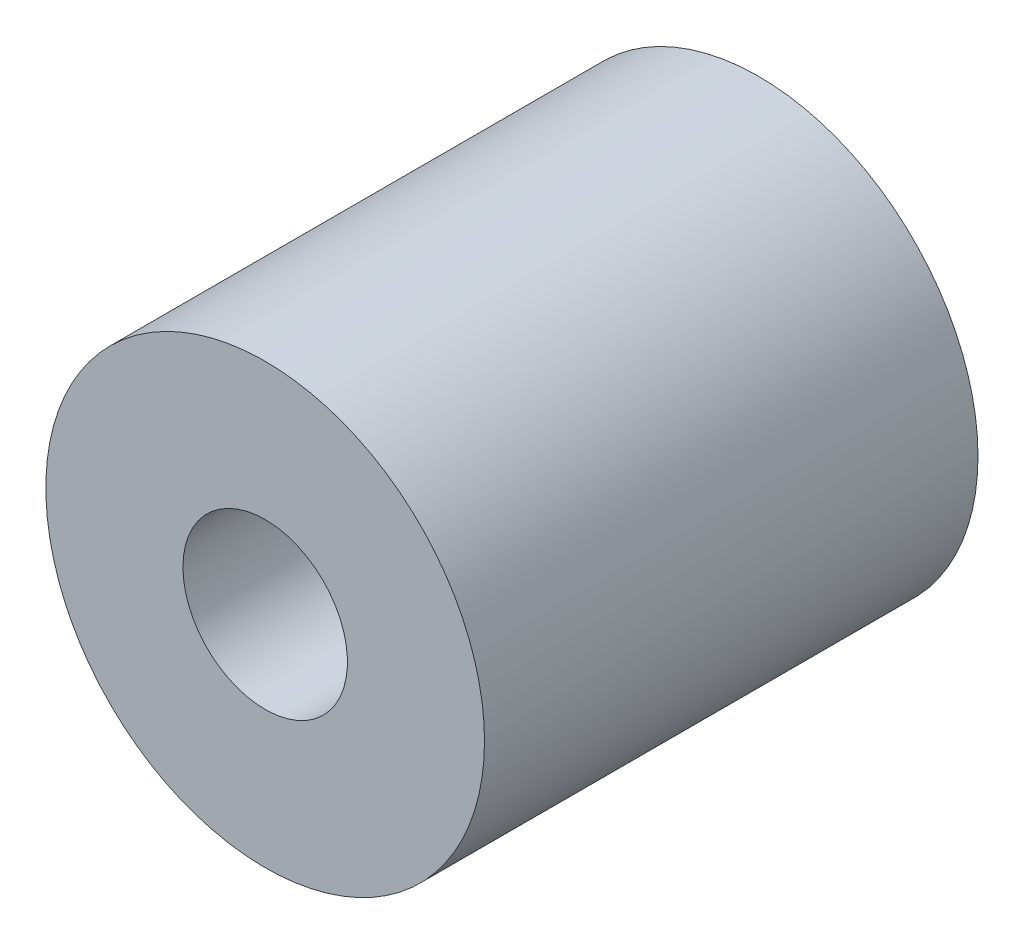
ISO-10303-21;
HEADER;
FILE_DESCRIPTION(('STEP AP214'),'2;1');
FILE_NAME('part.step','',(''),(''),'','','');
FILE_SCHEMA(('AUTOMOTIVE_DESIGN { 1 0 10303 214 1 1 1 1 }'));
ENDSEC;
DATA;
#1=APPLICATION_CONTEXT('core data for automotive mechanical design processes');
#2=APPLICATION_PROTOCOL_DEFINITION('international standard','automotive_design',2000,#1);
#3=PRODUCT_CONTEXT('',#1,'mechanical');
#4=PRODUCT('Part','Part','',(#3));
#5=PRODUCT_RELATED_PRODUCT_CATEGORY('part','',(#4));
#6=PRODUCT_DEFINITION_FORMATION('','',#4);
#7=PRODUCT_DEFINITION_CONTEXT('part definition',#1,'design');
#8=PRODUCT_DEFINITION('design','',#6,#7);
#9=PRODUCT_DEFINITION_SHAPE('','',#8);
#10=(LENGTH_UNIT() NAMED_UNIT(*) SI_UNIT(.MILLI.,.METRE.));
#11=(NAMED_UNIT(*) PLANE_ANGLE_UNIT() SI_UNIT($,.RADIAN.));
#12=(NAMED_UNIT(*) SI_UNIT($,.STERADIAN.) SOLID_ANGLE_UNIT());
#13=UNCERTAINTY_MEASURE_WITH_UNIT(LENGTH_MEASURE(1.E-05),#10,'distance_accuracy_value','');
#14=(GEOMETRIC_REPRESENTATION_CONTEXT(3) GLOBAL_UNCERTAINTY_ASSIGNED_CONTEXT((#13)) GLOBAL_UNIT_ASSIGNED_CONTEXT((#10,
#11,#12)) REPRESENTATION_CONTEXT('',''));
#15=CARTESIAN_POINT('',(0.,0.,0.));
#16=DIRECTION('',(0.,0.,1.));
#17=DIRECTION('',(1.,0.,0.));
#18=AXIS2_PLACEMENT_3D('',#15,#16,#17);
#19=CARTESIAN_POINT('',(0.,0.,18.));
#20=DIRECTION('',(0.,0.,-1.));
#21=DIRECTION('',(-1.,0.,0.));
#22=AXIS2_PLACEMENT_3D('',#19,#20,#21);
#23=CYLINDRICAL_SURFACE('',#22,8.);
#24=CARTESIAN_POINT('',(0.,0.,18.));
#25=DIRECTION('',(0.,0.,1.));
#26=DIRECTION('',(1.,0.,0.));
#27=AXIS2_PLACEMENT_3D('',#24,#25,#26);
#28=CIRCLE('',#27,8.);
#29=CARTESIAN_POINT('',(8.,0.,18.));
#30=VERTEX_POINT('',#29);
#31=EDGE_CURVE('E8',#30,#30,#28,.T.);
#32=ORIENTED_EDGE('',*,*,#31,.F.);
#33=EDGE_LOOP('',(#32));
#34=FACE_BOUND('',#33,.T.);
#35=CARTESIAN_POINT('',(0.,0.,0.));
#36=DIRECTION('',(0.,0.,1.));
#37=DIRECTION('',(1.,0.,0.));
#38=AXIS2_PLACEMENT_3D('',#35,#36,#37);
#39=CIRCLE('',#38,8.);
#40=CARTESIAN_POINT('',(8.,0.,0.));
#41=VERTEX_POINT('',#40);
#42=EDGE_CURVE('E18',#41,#41,#39,.T.);
#43=ORIENTED_EDGE('',*,*,#42,.T.);
#44=EDGE_LOOP('',(#43));
#45=FACE_BOUND('',#44,.T.);
#46=ADVANCED_FACE('F12',(#34,#45),#23,.T.);
#47=CARTESIAN_POINT('',(0.,0.,18.));
#48=DIRECTION('',(0.,0.,1.));
#49=DIRECTION('',(1.,0.,0.));
#50=AXIS2_PLACEMENT_3D('',#47,#48,#49);
#51=PLANE('',#50);
#52=CARTESIAN_POINT('',(0.,0.,18.));
#53=DIRECTION('',(0.,0.,-1.));
#54=DIRECTION('',(-1.,0.,0.));
#55=AXIS2_PLACEMENT_3D('',#52,#53,#54);
#56=CIRCLE('',#55,3.);
#57=CARTESIAN_POINT('',(-3.,0.,18.));
#58=VERTEX_POINT('',#57);
#59=EDGE_CURVE('E22',#58,#58,#56,.T.);
#60=ORIENTED_EDGE('',*,*,#59,.T.);
#61=EDGE_LOOP('',(#60));
#62=FACE_BOUND('',#61,.T.);
#63=ORIENTED_EDGE('',*,*,#31,.T.);
#64=EDGE_LOOP('',(#63));
#65=FACE_BOUND('',#64,.T.);
#66=ADVANCED_FACE('F37',(#62,#65),#51,.T.);
#67=CARTESIAN_POINT('',(0.,0.,0.));
#68=DIRECTION('',(0.,0.,1.));
#69=DIRECTION('',(1.,0.,0.));
#70=AXIS2_PLACEMENT_3D('',#67,#68,#69);
#71=PLANE('',#70);
#72=CARTESIAN_POINT('',(0.,0.,0.));
#73=DIRECTION('',(0.,0.,-1.));
#74=DIRECTION('',(-1.,0.,0.));
#75=AXIS2_PLACEMENT_3D('',#72,#73,#74);
#76=CIRCLE('',#75,3.);
#77=CARTESIAN_POINT('',(-3.,0.,0.));
#78=VERTEX_POINT('',#77);
#79=EDGE_CURVE('E26',#78,#78,#76,.T.);
#80=ORIENTED_EDGE('',*,*,#79,.F.);
#81=EDGE_LOOP('',(#80));
#82=FACE_BOUND('',#81,.T.);
#83=ORIENTED_EDGE('',*,*,#42,.F.);
#84=EDGE_LOOP('',(#83));
#85=FACE_BOUND('',#84,.T.);
#86=ADVANCED_FACE('F34',(#82,#85),#71,.F.);
#87=CARTESIAN_POINT('',(0.,0.,18.));
#88=DIRECTION('',(0.,0.,-1.));
#89=DIRECTION('',(-1.,0.,0.));
#90=AXIS2_PLACEMENT_3D('',#87,#88,#89);
#91=CYLINDRICAL_SURFACE('',#90,3.);
#92=ORIENTED_EDGE('',*,*,#59,.F.);
#93=EDGE_LOOP('',(#92));
#94=FACE_BOUND('',#93,.T.);
#95=ORIENTED_EDGE('',*,*,#79,.T.);
#96=EDGE_LOOP('',(#95));
#97=FACE_BOUND('',#96,.T.);
#98=ADVANCED_FACE('F32',(#94,#97),#91,.F.);
#99=CLOSED_SHELL('',(#46,#66,#86,#98));
#100=MANIFOLD_SOLID_BREP('B1',#99);
#101=ADVANCED_BREP_SHAPE_REPRESENTATION('',(#18,#100),#14);
#102=SHAPE_DEFINITION_REPRESENTATION(#9,#101);
ENDSEC;
END-ISO-10303-21;
